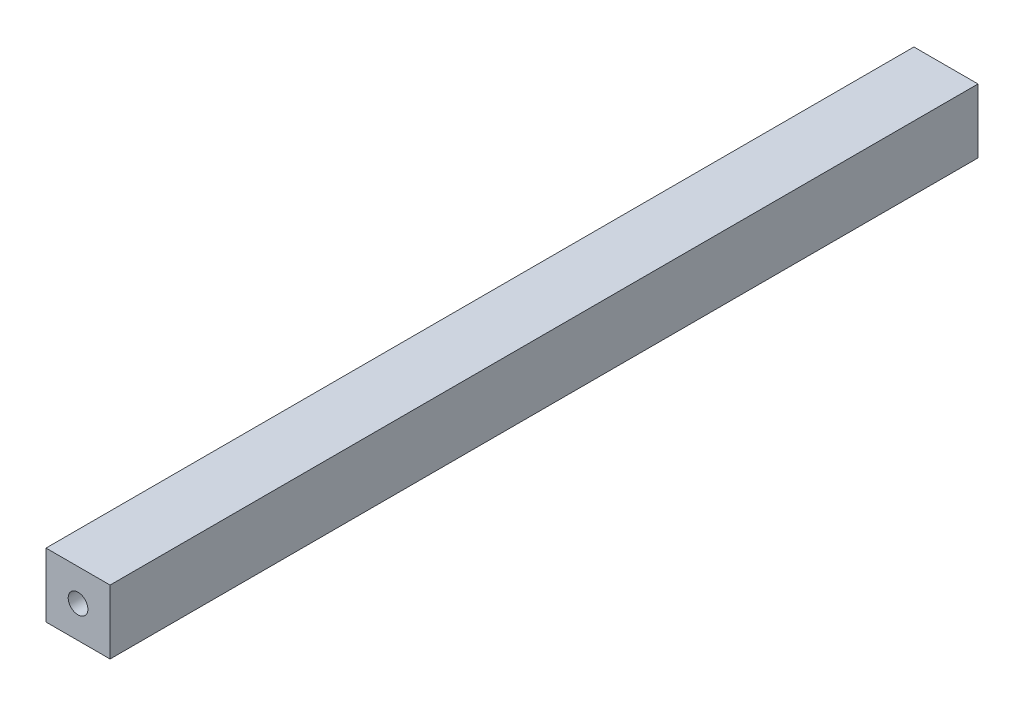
from build123d import *

# Parameters (mm, degrees)
ESQUISSE1_W             = 22
ESQUISSE1_H             = 22
BASE_EXTRUSION_DEPTH    = 298
ESQUISSE2_R             = 3.375
ENL_V_MAT_EXTRU_1_DEPTH = 25
ENL_V_START             = -25
ESQUISSE3_R             = 3.375
ENL_V_MAT_EXTRU_2_DEPTH = 25


with BuildPart() as part:
    # Esquisse1 → Base-Extrusion (new body)
    with BuildSketch(Plane.XY):
        with Locations((11, 11)):
            Rectangle(ESQUISSE1_W, ESQUISSE1_H)
    extrude(amount=BASE_EXTRUSION_DEPTH)

    # Esquisse2 → Enl_v. mat.-Extru.1 (cut)
    with BuildSketch(Plane.XY.offset(298)):
        with Locations((11, 11)):
            Circle(ESQUISSE2_R)
    extrude(amount=-ENL_V_MAT_EXTRU_1_DEPTH, mode=Mode.SUBTRACT)

    # Esquisse3 → Enl_v. mat.-Extru.2 (cut)
    with BuildSketch(Plane(origin=(0, 0, 0), x_dir=(-1, 0, 0), z_dir=(0, 0, -1)).offset(ENL_V_START)):
        with Locations(Location((-11, 11, 0), (0, 0, 180))):
            Circle(ESQUISSE3_R)
    extrude(amount=ENL_V_MAT_EXTRU_2_DEPTH, mode=Mode.SUBTRACT)


solid = part.part
